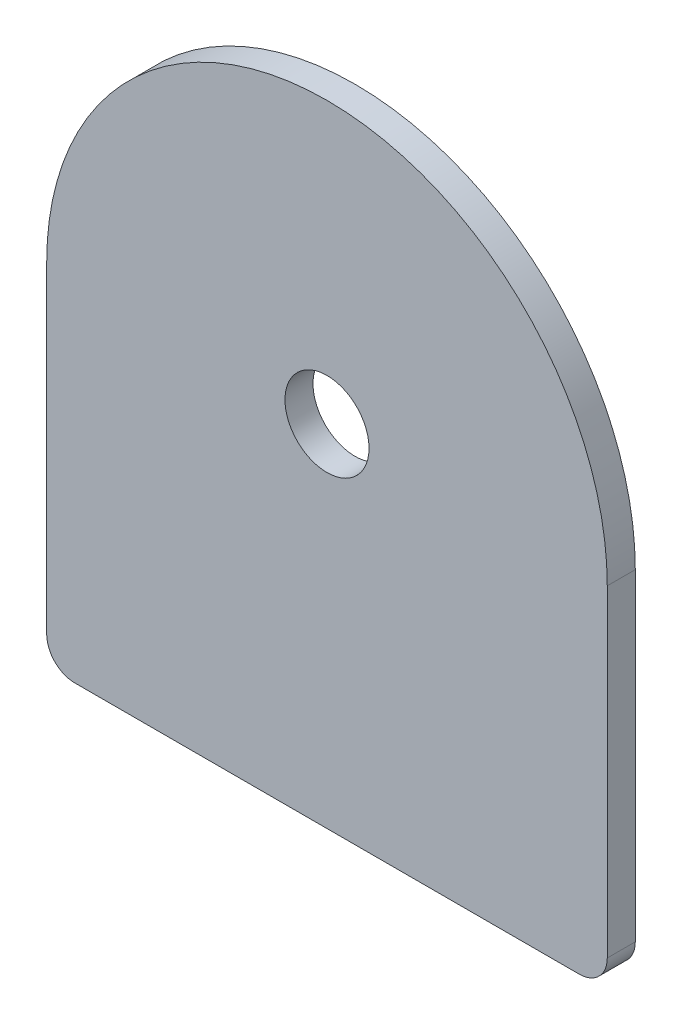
from build123d import *

# Parameters (mm, degrees)
ESQUISSE1_R      = 3
EXTRUSION1_DEPTH = 2


with BuildPart() as part:
    # Esquisse1 → Extrusion1 (new body)
    with BuildSketch(Plane.XY):
        with BuildLine():
            Line((-20, 0), (-20, -23))
            ThreePointArc((-20, -23), (-19.414213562, -24.414213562), (-18, -25))
            Line((-18, -25), (18, -25))
            ThreePointArc((18, -25), (19.414213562, -24.414213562), (20, -23))
            Line((20, -23), (20, 0))
            ThreePointArc((20, 0), (0, 20), (-20, 0))
        make_face()
        Circle(ESQUISSE1_R, mode=Mode.SUBTRACT)
    extrude(amount=EXTRUSION1_DEPTH)


solid = part.part
